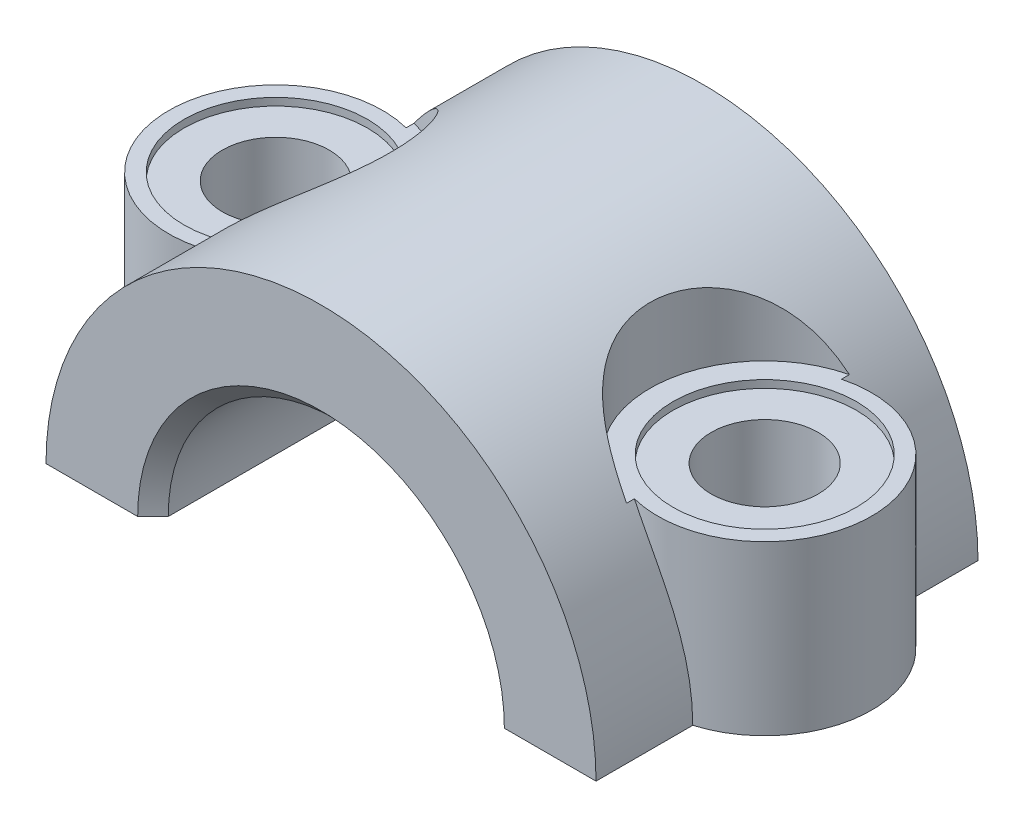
from build123d import *

# Parameters (mm, degrees)
BOSS_EXTRUDE1_DEPTH          = 79.375
SKETCH3_R                    = 22.225
BOSS_EXTRUDE2_DEPTH          = 34.925
SKETCH4_R                    = 23.8252
CUT_EXTRUDE1_DEPTH           = 34.925
F_7_8_0_875_DIAMETER_HOLE1_D = 22.225
SKETCH7_R                    = 19.05
CUT_EXTRUDE2_DEPTH           = 1.5748
SKETCH8_R                    = 34.925
CUT_EXTRUDE3_DEPTH           = 123.062130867
CHAMFER1_SIZE                = 3.175


with BuildPart() as part:
    # Sketch1 → Boss-Extrude1 (new body)
    with BuildSketch(Plane.XY):
        with BuildLine():
            Line((-57.15, 0), (57.15, 0))
            ThreePointArc((57.15, 0), (0, 57.15), (-57.15, 0))
        make_face()
    extrude(amount=BOSS_EXTRUDE1_DEPTH)

    # Sketch3 → Boss-Extrude2 (add)
    with BuildSketch(Plane.XZ):
        with Locations((-50.8, 37.973)):
            Circle(SKETCH3_R)
        with Locations((50.8, 37.973)):
            Circle(SKETCH3_R)
    extrude(amount=-BOSS_EXTRUDE2_DEPTH)

    # Sketch4 → Cut-Extrude1 (cut)
    with BuildSketch(Plane(origin=(0, 34.925, 0), x_dir=(1, 0, 0), z_dir=(0, 1, 0))):
        with Locations((-50.8, -37.973)):
            Circle(SKETCH4_R)
        with Locations((50.8, -37.973)):
            Circle(SKETCH4_R)
    extrude(amount=CUT_EXTRUDE1_DEPTH, mode=Mode.SUBTRACT)

    # 7_8 _0.875_ Diameter Hole1 (through all)
    with Locations(Plane(origin=(0, 0, 0), x_dir=(-1, 0, 0), z_dir=(0, -1, 0))):
        with Locations((-50.8, -37.973), (50.8, -37.973)):
            Hole(F_7_8_0_875_DIAMETER_HOLE1_D / 2)

    # Sketch7 → Cut-Extrude2 (cut)
    with BuildSketch(Plane(origin=(0, 34.925, 0), x_dir=(1, 0, 0), z_dir=(0, 1, 0))):
        with Locations(Location((-50.8, -37.973, 0), (0, 0, 270))):
            Circle(SKETCH7_R)
        with Locations(Location((50.8, -37.973, 0), (0, 0, 270))):
            Circle(SKETCH7_R)
    extrude(amount=-CUT_EXTRUDE2_DEPTH, mode=Mode.SUBTRACT)

    # Sketch8 → Cut-Extrude3 (cut, through all)
    with BuildSketch(Plane.XY.offset(79.375)):
        Circle(SKETCH8_R)
    extrude(amount=-CUT_EXTRUDE3_DEPTH, mode=Mode.SUBTRACT)

    # Chamfer1
    chamfer1_edges = [part.edges().sort_by_distance(p)[0] for p in [
        (0, 34.925, 79.375),
        (0, 34.925, 0),
    ]]
    chamfer(chamfer1_edges, length=CHAMFER1_SIZE)


solid = part.part
